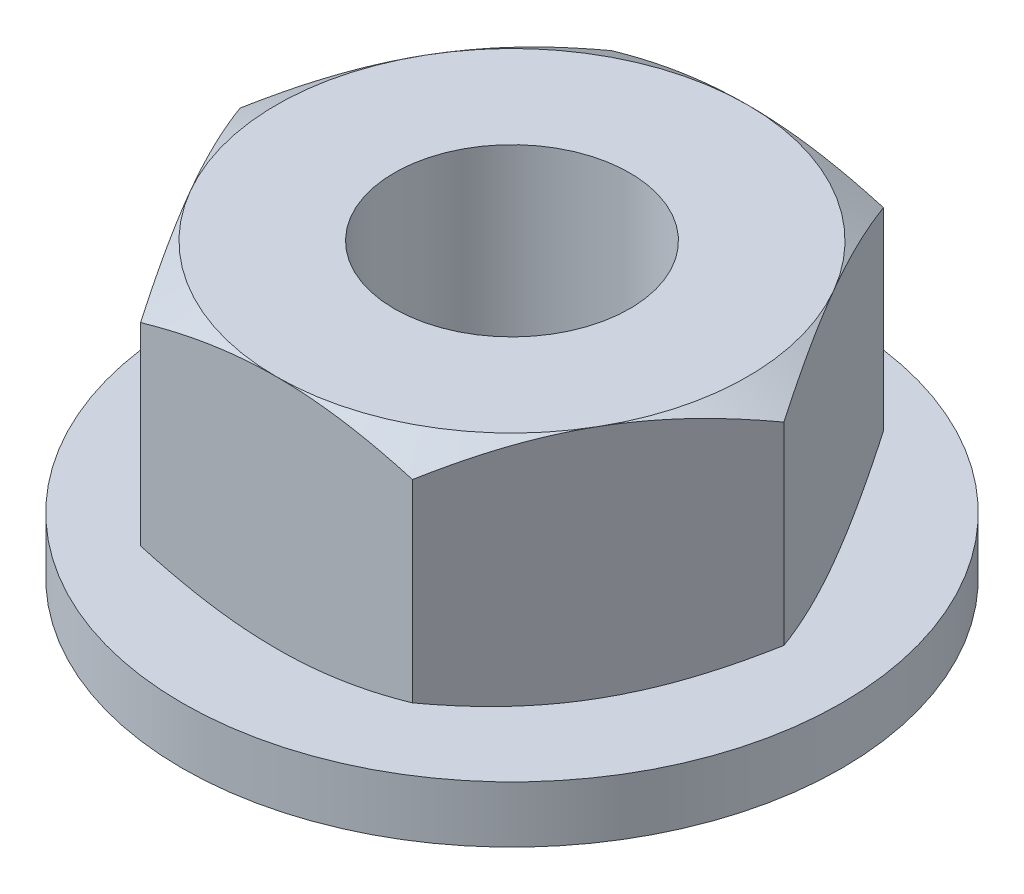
ISO-10303-21;
HEADER;
FILE_DESCRIPTION(('STEP AP214'),'2;1');
FILE_NAME('part.step','',(''),(''),'','','');
FILE_SCHEMA(('AUTOMOTIVE_DESIGN { 1 0 10303 214 1 1 1 1 }'));
ENDSEC;
DATA;
#1=APPLICATION_CONTEXT('core data for automotive mechanical design processes');
#2=APPLICATION_PROTOCOL_DEFINITION('international standard','automotive_design',2000,#1);
#3=PRODUCT_CONTEXT('',#1,'mechanical');
#4=PRODUCT('Part','Part','',(#3));
#5=PRODUCT_RELATED_PRODUCT_CATEGORY('part','',(#4));
#6=PRODUCT_DEFINITION_FORMATION('','',#4);
#7=PRODUCT_DEFINITION_CONTEXT('part definition',#1,'design');
#8=PRODUCT_DEFINITION('design','',#6,#7);
#9=PRODUCT_DEFINITION_SHAPE('','',#8);
#10=(LENGTH_UNIT() NAMED_UNIT(*) SI_UNIT(.MILLI.,.METRE.));
#11=(NAMED_UNIT(*) PLANE_ANGLE_UNIT() SI_UNIT($,.RADIAN.));
#12=(NAMED_UNIT(*) SI_UNIT($,.STERADIAN.) SOLID_ANGLE_UNIT());
#13=UNCERTAINTY_MEASURE_WITH_UNIT(LENGTH_MEASURE(1.E-05),#10,'distance_accuracy_value','');
#14=(GEOMETRIC_REPRESENTATION_CONTEXT(3) GLOBAL_UNCERTAINTY_ASSIGNED_CONTEXT((#13)) GLOBAL_UNIT_ASSIGNED_CONTEXT((#10,
#11,#12)) REPRESENTATION_CONTEXT('',''));
#15=CARTESIAN_POINT('',(0.,0.,0.));
#16=DIRECTION('',(0.,0.,1.));
#17=DIRECTION('',(1.,0.,0.));
#18=AXIS2_PLACEMENT_3D('',#15,#16,#17);
#19=CARTESIAN_POINT('',(8.66025403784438,-2.5,-5.00000000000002));
#20=DIRECTION('',(0.,1.,0.));
#21=DIRECTION('',(0.,0.,1.));
#22=AXIS2_PLACEMENT_3D('',#19,#20,#21);
#23=PLANE('',#22);
#24=CARTESIAN_POINT('',(0.,-2.50000000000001,0.));
#25=DIRECTION('',(0.,1.,0.));
#26=DIRECTION('',(0.,0.,1.));
#27=AXIS2_PLACEMENT_3D('',#24,#25,#26);
#28=CIRCLE('',#27,2.5);
#29=CARTESIAN_POINT('',(0.,-2.50000000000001,2.5));
#30=VERTEX_POINT('',#29);
#31=EDGE_CURVE('E153',#30,#30,#28,.T.);
#32=ORIENTED_EDGE('',*,*,#31,.T.);
#33=EDGE_LOOP('',(#32));
#34=FACE_BOUND('',#33,.T.);
#35=CARTESIAN_POINT('',(0.,-2.5,0.));
#36=DIRECTION('',(0.,1.,0.));
#37=DIRECTION('',(0.,0.,1.));
#38=AXIS2_PLACEMENT_3D('',#35,#36,#37);
#39=CIRCLE('',#38,3.5);
#40=CARTESIAN_POINT('',(0.,-2.5,3.5));
#41=VERTEX_POINT('',#40);
#42=EDGE_CURVE('E11',#41,#41,#39,.T.);
#43=ORIENTED_EDGE('',*,*,#42,.F.);
#44=EDGE_LOOP('',(#43));
#45=FACE_BOUND('',#44,.T.);
#46=ADVANCED_FACE('F31',(#34,#45),#23,.F.);
#47=CARTESIAN_POINT('',(2.88675134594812,2.5,5.00000000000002));
#48=DIRECTION('',(-0.866025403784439,0.,-0.499999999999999));
#49=DIRECTION('',(-0.499999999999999,0.,0.866025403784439));
#50=AXIS2_PLACEMENT_3D('',#47,#48,#49);
#51=PLANE('',#50);
#52=CARTESIAN_POINT('',(5.7736181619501,-2.05335134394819,-0.000200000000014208));
#53=CARTESIAN_POINT('',(5.64675433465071,-2.12661343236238,0.219534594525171));
#54=CARTESIAN_POINT('',(5.5188054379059,-2.19324867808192,0.441148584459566));
#55=CARTESIAN_POINT('',(5.26069210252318,-2.3095610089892,0.888213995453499));
#56=CARTESIAN_POINT('',(5.13052307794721,-2.35919695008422,1.11367335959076));
#57=CARTESIAN_POINT('',(4.87177839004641,-2.43644897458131,1.56183230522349));
#58=CARTESIAN_POINT('',(4.74324302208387,-2.46457962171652,1.78446209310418));
#59=CARTESIAN_POINT('',(4.54998783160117,-2.48980507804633,2.11918990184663));
#60=CARTESIAN_POINT('',(4.48552534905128,-2.49538654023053,2.23084219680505));
#61=CARTESIAN_POINT('',(4.35654081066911,-2.50079778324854,2.45424997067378));
#62=CARTESIAN_POINT('',(4.2920187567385,-2.50062774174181,2.5660054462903));
#63=CARTESIAN_POINT('',(4.11524635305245,-2.49224636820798,2.87218423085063));
#64=CARTESIAN_POINT('',(4.00305457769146,-2.47817022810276,3.0665060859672));
#65=CARTESIAN_POINT('',(3.77941563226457,-2.43353474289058,3.4538601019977));
#66=CARTESIAN_POINT('',(3.66796924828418,-2.40296013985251,3.64689090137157));
#67=CARTESIAN_POINT('',(3.44387972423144,-2.32653150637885,4.03502534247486));
#68=CARTESIAN_POINT('',(3.3312648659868,-2.28035362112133,4.23007999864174));
#69=CARTESIAN_POINT('',(3.1077146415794,-2.17554820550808,4.61728034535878));
#70=CARTESIAN_POINT('',(2.99677641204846,-2.11694529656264,4.8094309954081));
#71=CARTESIAN_POINT('',(2.88663587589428,-2.05335134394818,5.00020000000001));
#72=B_SPLINE_CURVE_WITH_KNOTS('',3,(#52,#53,#54,#55,#56,#57,#58,#59,#60,#61,#62,#63,#64,#65,#66,
#67,#68,#69,#70,#71),.UNSPECIFIED.,.F.,.F.,(4,2,2,2,2,2,2,2,2,4),(0.,0.792555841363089,
1.58701660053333,2.3618153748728,2.74884076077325,3.13585419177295,3.8096236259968,
4.4840172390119,5.17336882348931,5.86136694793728),.UNSPECIFIED.);
#73=CARTESIAN_POINT('',(5.77350269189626,-2.05341801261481,0.));
#74=VERTEX_POINT('',#73);
#75=CARTESIAN_POINT('',(4.33012701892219,-2.5,2.5));
#76=VERTEX_POINT('',#75);
#77=EDGE_CURVE('E191',#74,#76,#72,.T.);
#78=ORIENTED_EDGE('',*,*,#77,.F.);
#79=DIRECTION('',(0.,-1.,0.));
#80=VECTOR('',#79,1.);
#81=CARTESIAN_POINT('',(5.77350269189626,2.5,0.));
#82=LINE('',#81,#80);
#83=CARTESIAN_POINT('',(5.77350269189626,2.05341801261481,0.));
#84=VERTEX_POINT('',#83);
#85=EDGE_CURVE('E278',#84,#74,#82,.T.);
#86=ORIENTED_EDGE('',*,*,#85,.F.);
#87=CARTESIAN_POINT('',(2.88663587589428,2.05335134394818,5.00020000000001));
#88=CARTESIAN_POINT('',(3.01349970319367,2.12661343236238,4.78046540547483));
#89=CARTESIAN_POINT('',(3.14144859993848,2.19324867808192,4.55885141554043));
#90=CARTESIAN_POINT('',(3.3995619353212,2.3095610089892,4.1117860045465));
#91=CARTESIAN_POINT('',(3.52973095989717,2.35919695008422,3.88632664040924));
#92=CARTESIAN_POINT('',(3.78847564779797,2.43644897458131,3.4381676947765));
#93=CARTESIAN_POINT('',(3.91701101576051,2.46457962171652,3.21553790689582));
#94=CARTESIAN_POINT('',(4.11026620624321,2.48980507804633,2.88081009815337));
#95=CARTESIAN_POINT('',(4.1747286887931,2.49538654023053,2.76915780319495));
#96=CARTESIAN_POINT('',(4.30371322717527,2.50079778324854,2.54575002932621));
#97=CARTESIAN_POINT('',(4.36823528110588,2.50062774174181,2.4339945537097));
#98=CARTESIAN_POINT('',(4.54500768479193,2.49224636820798,2.12781576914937));
#99=CARTESIAN_POINT('',(4.65719946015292,2.47817022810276,1.93349391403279));
#100=CARTESIAN_POINT('',(4.88083840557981,2.43353474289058,1.5461398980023));
#101=CARTESIAN_POINT('',(4.9922847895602,2.40296013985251,1.35310909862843));
#102=CARTESIAN_POINT('',(5.21637431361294,2.32653150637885,0.964974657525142));
#103=CARTESIAN_POINT('',(5.32898917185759,2.28035362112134,0.769920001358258));
#104=CARTESIAN_POINT('',(5.55253939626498,2.17554820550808,0.382719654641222));
#105=CARTESIAN_POINT('',(5.66347762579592,2.11694529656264,0.190569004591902));
#106=CARTESIAN_POINT('',(5.7736181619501,2.05335134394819,-0.000200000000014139));
#107=B_SPLINE_CURVE_WITH_KNOTS('',3,(#87,#88,#89,#90,#91,#92,#93,#94,#95,#96,#97,#98,#99,#100,
#101,#102,#103,#104,#105,#106),.UNSPECIFIED.,.F.,.F.,(4,2,2,2,2,2,2,2,2,4),(0.,
0.792555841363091,1.58701660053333,2.36181537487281,2.74884076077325,3.13585419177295,
3.8096236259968,4.48401723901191,5.17336882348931,5.86136694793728),.UNSPECIFIED.);
#108=CARTESIAN_POINT('',(4.33012701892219,2.5,2.5));
#109=VERTEX_POINT('',#108);
#110=EDGE_CURVE('E190',#109,#84,#107,.T.);
#111=ORIENTED_EDGE('',*,*,#110,.F.);
#112=CARTESIAN_POINT('',(2.88675134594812,2.05341801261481,5.00000000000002));
#113=VERTEX_POINT('',#112);
#114=EDGE_CURVE('E310',#113,#109,#107,.T.);
#115=ORIENTED_EDGE('',*,*,#114,.F.);
#116=DIRECTION('',(0.,-1.,0.));
#117=VECTOR('',#116,1.);
#118=CARTESIAN_POINT('',(2.88675134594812,2.5,5.00000000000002));
#119=LINE('',#118,#117);
#120=CARTESIAN_POINT('',(2.88675134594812,-2.05341801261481,5.00000000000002));
#121=VERTEX_POINT('',#120);
#122=EDGE_CURVE('E306',#113,#121,#119,.T.);
#123=ORIENTED_EDGE('',*,*,#122,.T.);
#124=EDGE_CURVE('E142',#76,#121,#72,.T.);
#125=ORIENTED_EDGE('',*,*,#124,.F.);
#126=EDGE_LOOP('',(#78,#86,#111,#115,#123,#125));
#127=FACE_BOUND('',#126,.T.);
#128=ADVANCED_FACE('F33',(#127),#51,.F.);
#129=CARTESIAN_POINT('',(5.77350269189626,2.5,0.));
#130=DIRECTION('',(-0.866025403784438,0.,0.5));
#131=DIRECTION('',(0.5,0.,0.866025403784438));
#132=AXIS2_PLACEMENT_3D('',#129,#130,#131);
#133=PLANE('',#132);
#134=CARTESIAN_POINT('',(2.88663587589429,-2.05335134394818,-5.00020000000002));
#135=CARTESIAN_POINT('',(3.01349970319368,-2.12661343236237,-4.78046540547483));
#136=CARTESIAN_POINT('',(3.14144859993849,-2.19324867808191,-4.55885141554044));
#137=CARTESIAN_POINT('',(3.3995619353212,-2.3095610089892,-4.1117860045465));
#138=CARTESIAN_POINT('',(3.52973095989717,-2.35919695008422,-3.88632664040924));
#139=CARTESIAN_POINT('',(3.78847564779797,-2.43644897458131,-3.43816769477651));
#140=CARTESIAN_POINT('',(3.91701101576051,-2.46457962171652,-3.21553790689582));
#141=CARTESIAN_POINT('',(4.11026620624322,-2.48980507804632,-2.88081009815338));
#142=CARTESIAN_POINT('',(4.17472868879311,-2.49538654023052,-2.76915780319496));
#143=CARTESIAN_POINT('',(4.30371322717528,-2.50079778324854,-2.54575002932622));
#144=CARTESIAN_POINT('',(4.36823528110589,-2.5006277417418,-2.4339945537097));
#145=CARTESIAN_POINT('',(4.54500768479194,-2.49224636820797,-2.12781576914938));
#146=CARTESIAN_POINT('',(4.65719946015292,-2.47817022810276,-1.9334939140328));
#147=CARTESIAN_POINT('',(4.88083840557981,-2.43353474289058,-1.54613989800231));
#148=CARTESIAN_POINT('',(4.9922847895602,-2.4029601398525,-1.35310909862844));
#149=CARTESIAN_POINT('',(5.21637431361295,-2.32653150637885,-0.96497465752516));
#150=CARTESIAN_POINT('',(5.32898917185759,-2.28035362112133,-0.769920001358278));
#151=CARTESIAN_POINT('',(5.55253939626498,-2.17554820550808,-0.382719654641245));
#152=CARTESIAN_POINT('',(5.66347762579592,-2.11694529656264,-0.190569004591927));
#153=CARTESIAN_POINT('',(5.7736181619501,-2.05335134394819,0.000199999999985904));
#154=B_SPLINE_CURVE_WITH_KNOTS('',3,(#134,#135,#136,#137,#138,#139,#140,#141,#142,#143,#144,
#145,#146,#147,#148,#149,#150,#151,#152,#153),.UNSPECIFIED.,.F.,.F.,(4,2,2,2,2,2,2,2,2,4),(0.,
0.792555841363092,1.58701660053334,2.36181537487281,2.74884076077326,3.13585419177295,
3.8096236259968,4.4840172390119,5.17336882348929,5.86136694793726),.UNSPECIFIED.);
#155=CARTESIAN_POINT('',(2.88675134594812,-2.05341801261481,-5.00000000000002));
#156=VERTEX_POINT('',#155);
#157=CARTESIAN_POINT('',(4.33012701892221,-2.5,-2.50000000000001));
#158=VERTEX_POINT('',#157);
#159=EDGE_CURVE('E193',#156,#158,#154,.T.);
#160=ORIENTED_EDGE('',*,*,#159,.F.);
#161=DIRECTION('',(0.,-1.,0.));
#162=VECTOR('',#161,1.);
#163=CARTESIAN_POINT('',(2.88675134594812,2.5,-5.00000000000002));
#164=LINE('',#163,#162);
#165=CARTESIAN_POINT('',(2.88675134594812,2.05341801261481,-5.00000000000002));
#166=VERTEX_POINT('',#165);
#167=EDGE_CURVE('E275',#166,#156,#164,.T.);
#168=ORIENTED_EDGE('',*,*,#167,.F.);
#169=CARTESIAN_POINT('',(5.7736181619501,2.05335134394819,0.000199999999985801));
#170=CARTESIAN_POINT('',(5.64675433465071,2.12661343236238,-0.219534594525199));
#171=CARTESIAN_POINT('',(5.5188054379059,2.19324867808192,-0.441148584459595));
#172=CARTESIAN_POINT('',(5.26069210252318,2.3095610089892,-0.888213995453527));
#173=CARTESIAN_POINT('',(5.13052307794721,2.35919695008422,-1.11367335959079));
#174=CARTESIAN_POINT('',(4.87177839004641,2.43644897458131,-1.56183230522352));
#175=CARTESIAN_POINT('',(4.74324302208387,2.46457962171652,-1.7844620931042));
#176=CARTESIAN_POINT('',(4.54998783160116,2.48980507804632,-2.11918990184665));
#177=CARTESIAN_POINT('',(4.48552534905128,2.49538654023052,-2.23084219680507));
#178=CARTESIAN_POINT('',(4.35654081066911,2.50079778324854,-2.45424997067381));
#179=CARTESIAN_POINT('',(4.2920187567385,2.5006277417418,-2.56600544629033));
#180=CARTESIAN_POINT('',(4.11524635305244,2.49224636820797,-2.87218423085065));
#181=CARTESIAN_POINT('',(4.00305457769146,2.47817022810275,-3.06650608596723));
#182=CARTESIAN_POINT('',(3.77941563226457,2.43353474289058,-3.45386010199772));
#183=CARTESIAN_POINT('',(3.66796924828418,2.4029601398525,-3.64689090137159));
#184=CARTESIAN_POINT('',(3.44387972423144,2.32653150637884,-4.03502534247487));
#185=CARTESIAN_POINT('',(3.3312648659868,2.28035362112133,-4.23007999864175));
#186=CARTESIAN_POINT('',(3.1077146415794,2.17554820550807,-4.61728034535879));
#187=CARTESIAN_POINT('',(2.99677641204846,2.11694529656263,-4.80943099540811));
#188=CARTESIAN_POINT('',(2.88663587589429,2.05335134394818,-5.00020000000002));
#189=B_SPLINE_CURVE_WITH_KNOTS('',3,(#169,#170,#171,#172,#173,#174,#175,#176,#177,#178,#179,
#180,#181,#182,#183,#184,#185,#186,#187,#188),.UNSPECIFIED.,.F.,.F.,(4,2,2,2,2,2,2,2,2,4),(0.,
0.79255584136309,1.58701660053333,2.3618153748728,2.74884076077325,3.13585419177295,
3.80962362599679,4.48401723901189,5.17336882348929,5.86136694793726),.UNSPECIFIED.);
#190=CARTESIAN_POINT('',(4.3301270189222,2.5,-2.5));
#191=VERTEX_POINT('',#190);
#192=EDGE_CURVE('E318',#191,#166,#189,.T.);
#193=ORIENTED_EDGE('',*,*,#192,.F.);
#194=EDGE_CURVE('E213',#84,#191,#189,.T.);
#195=ORIENTED_EDGE('',*,*,#194,.F.);
#196=ORIENTED_EDGE('',*,*,#85,.T.);
#197=EDGE_CURVE('E539',#158,#74,#154,.T.);
#198=ORIENTED_EDGE('',*,*,#197,.F.);
#199=EDGE_LOOP('',(#160,#168,#193,#195,#196,#198));
#200=FACE_BOUND('',#199,.T.);
#201=ADVANCED_FACE('F333',(#200),#133,.F.);
#202=CARTESIAN_POINT('',(2.88675134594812,2.5,-5.00000000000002));
#203=DIRECTION('',(0.,0.,1.));
#204=DIRECTION('',(1.,0.,0.));
#205=AXIS2_PLACEMENT_3D('',#202,#203,#204);
#206=PLANE('',#205);
#207=CARTESIAN_POINT('',(-7.83582824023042,-0.0201818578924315,-5.00000000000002));
#208=CARTESIAN_POINT('',(-7.61675258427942,-0.126778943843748,-5.00000000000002));
#209=CARTESIAN_POINT('',(-7.39718272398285,-0.232377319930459,-5.00000000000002));
#210=CARTESIAN_POINT('',(-6.95679209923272,-0.441016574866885,-5.00000000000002));
#211=CARTESIAN_POINT('',(-6.73597115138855,-0.54405706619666,-5.00000000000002));
#212=CARTESIAN_POINT('',(-6.29171673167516,-0.747521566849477,-5.00000000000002));
#213=CARTESIAN_POINT('',(-6.06827562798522,-0.847928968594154,-5.00000000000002));
#214=CARTESIAN_POINT('',(-5.61964466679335,-1.04474266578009,-5.00000000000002));
#215=CARTESIAN_POINT('',(-5.39445489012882,-1.14114914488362,-5.00000000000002));
#216=CARTESIAN_POINT('',(-4.93438073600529,-1.33205603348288,-5.00000000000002));
#217=CARTESIAN_POINT('',(-4.69942447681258,-1.42638413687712,-5.00000000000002));
#218=CARTESIAN_POINT('',(-4.22679335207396,-1.60809698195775,-5.00000000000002));
#219=CARTESIAN_POINT('',(-3.98911818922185,-1.69548095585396,-5.00000000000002));
#220=CARTESIAN_POINT('',(-3.51109032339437,-1.86107114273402,-5.00000000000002));
#221=CARTESIAN_POINT('',(-3.27074388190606,-1.93929525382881,-5.00000000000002));
#222=CARTESIAN_POINT('',(-2.78660382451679,-2.08410963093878,-5.00000000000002));
#223=CARTESIAN_POINT('',(-2.54281129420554,-2.15070347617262,-5.00000000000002));
#224=CARTESIAN_POINT('',(-2.05301710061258,-2.26875493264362,-5.00000000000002));
#225=CARTESIAN_POINT('',(-1.80703640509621,-2.32029796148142,-5.00000000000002));
#226=CARTESIAN_POINT('',(-1.31193168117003,-2.40539626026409,-5.00000000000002));
#227=CARTESIAN_POINT('',(-1.0628079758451,-2.43895336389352,-5.00000000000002));
#228=CARTESIAN_POINT('',(-0.565948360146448,-2.48496717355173,-5.00000000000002));
#229=CARTESIAN_POINT('',(-0.318238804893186,-2.49770143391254,-5.00000000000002));
#230=CARTESIAN_POINT('',(0.17737746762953,-2.50172580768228,-5.00000000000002));
#231=CARTESIAN_POINT('',(0.425284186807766,-2.4930157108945,-5.00000000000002));
#232=CARTESIAN_POINT('',(0.843772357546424,-2.46083600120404,-5.00000000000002));
#233=CARTESIAN_POINT('',(1.01479089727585,-2.44270146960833,-5.00000000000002));
#234=CARTESIAN_POINT('',(1.35562158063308,-2.39731277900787,-5.00000000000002));
#235=CARTESIAN_POINT('',(1.52543356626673,-2.37005744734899,-5.00000000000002));
#236=CARTESIAN_POINT('',(2.0328088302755,-2.2760379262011,-5.00000000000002));
#237=CARTESIAN_POINT('',(2.36813213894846,-2.19703587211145,-5.00000000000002));
#238=CARTESIAN_POINT('',(2.86963272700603,-2.05946652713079,-5.00000000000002));
#239=CARTESIAN_POINT('',(3.03839424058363,-2.00977811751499,-5.00000000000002));
#240=CARTESIAN_POINT('',(3.37427940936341,-1.90509537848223,-5.00000000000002));
#241=CARTESIAN_POINT('',(3.54140305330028,-1.85010101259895,-5.00000000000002));
#242=CARTESIAN_POINT('',(3.87406252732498,-1.73570084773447,-5.00000000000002));
#243=CARTESIAN_POINT('',(4.03959882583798,-1.67629639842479,-5.00000000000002));
#244=CARTESIAN_POINT('',(4.36929036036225,-1.55378935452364,-5.00000000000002));
#245=CARTESIAN_POINT('',(4.53344561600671,-1.49068681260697,-5.00000000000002));
#246=CARTESIAN_POINT('',(4.93359002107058,-1.33251408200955,-5.00000000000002));
#247=CARTESIAN_POINT('',(5.16891080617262,-1.23575576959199,-5.00000000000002));
#248=CARTESIAN_POINT('',(5.63743106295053,-1.03721704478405,-5.00000000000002));
#249=CARTESIAN_POINT('',(5.87063037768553,-0.935436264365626,-5.00000000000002));
#250=CARTESIAN_POINT('',(6.33531777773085,-0.727904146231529,-5.00000000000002));
#251=CARTESIAN_POINT('',(6.56680543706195,-0.622151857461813,-5.00000000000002));
#252=CARTESIAN_POINT('',(7.02832278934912,-0.407506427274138,-5.00000000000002));
#253=CARTESIAN_POINT('',(7.25835244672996,-0.298613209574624,-5.00000000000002));
#254=CARTESIAN_POINT('',(7.71747583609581,-0.0781683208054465,-5.00000000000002));
#255=CARTESIAN_POINT('',(7.94656809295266,0.0333864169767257,-5.00000000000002));
#256=CARTESIAN_POINT('',(8.40373705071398,0.258559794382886,-5.00000000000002));
#257=CARTESIAN_POINT('',(8.63181374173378,0.372178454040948,-5.00000000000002));
#258=CARTESIAN_POINT('',(9.31470112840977,0.715524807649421,-5.00000000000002));
#259=CARTESIAN_POINT('',(9.76824174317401,0.947778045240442,-5.00000000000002));
#260=CARTESIAN_POINT('',(10.6324695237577,1.39599360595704,-5.00000000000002));
#261=CARTESIAN_POINT('',(11.0433644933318,1.61155711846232,-5.00000000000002));
#262=CARTESIAN_POINT('',(11.8636388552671,2.04558815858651,-5.00000000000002));
#263=CARTESIAN_POINT('',(12.2730181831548,2.26405580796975,-5.00000000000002));
#264=CARTESIAN_POINT('',(13.0894643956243,2.70257621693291,-5.00000000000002));
#265=CARTESIAN_POINT('',(13.4965345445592,2.9226229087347,-5.00000000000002));
#266=CARTESIAN_POINT('',(14.3097130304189,3.36442738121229,-5.00000000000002));
#267=CARTESIAN_POINT('',(14.7158214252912,3.58618505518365,-5.00000000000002));
#268=CARTESIAN_POINT('',(15.1215799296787,3.80857680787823,-5.00000000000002));
#269=B_SPLINE_CURVE_WITH_KNOTS('',3,(#207,#208,#209,#210,#211,#212,#213,#214,#215,#216,#217,
#218,#219,#220,#221,#222,#223,#224,#225,#226,#227,#228,#229,#230,#231,#232,#233,#234,#235,#236,
#237,#238,#239,#240,#241,#242,#243,#244,#245,#246,#247,#248,#249,#250,#251,#252,#253,#254,#255,
#256,#257,#258,#259,#260,#261,#262,#263,#264,#265,#266,#267,#268),.UNSPECIFIED.,.F.,.F.,(4,2,2,
2,2,2,2,2,2,2,2,2,2,2,2,2,2,2,2,2,2,2,2,2,2,2,2,2,2,2,4),(0.,0.730907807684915,1.46192568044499,
2.19678752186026,2.93161559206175,3.69108328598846,4.45063483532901,5.20867656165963,
5.96648458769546,6.71990430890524,7.47324720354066,8.21646418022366,8.95968844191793,
9.47537174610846,9.99112137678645,11.0231580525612,11.5508843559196,12.0786142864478,
12.6061833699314,13.1337449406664,13.8969744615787,14.6602599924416,15.4237294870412,
16.187217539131,16.9516324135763,17.7160547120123,19.2446573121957,20.636665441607,
22.0287321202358,23.416942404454,24.805066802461),.UNSPECIFIED.);
#270=CARTESIAN_POINT('',(-2.88675134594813,-2.0534180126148,-5.00000000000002));
#271=VERTEX_POINT('',#270);
#272=CARTESIAN_POINT('',(0.,-2.5,-5.00000000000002));
#273=VERTEX_POINT('',#272);
#274=EDGE_CURVE('E252',#271,#273,#269,.T.);
#275=ORIENTED_EDGE('',*,*,#274,.F.);
#276=DIRECTION('',(0.,-1.,0.));
#277=VECTOR('',#276,1.);
#278=CARTESIAN_POINT('',(-2.88675134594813,2.5,-5.00000000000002));
#279=LINE('',#278,#277);
#280=CARTESIAN_POINT('',(-2.88675134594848,2.05341801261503,-5.00000000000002));
#281=VERTEX_POINT('',#280);
#282=EDGE_CURVE('E271',#281,#271,#279,.T.);
#283=ORIENTED_EDGE('',*,*,#282,.F.);
#284=CARTESIAN_POINT('',(-7.83582824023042,0.0201818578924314,-5.00000000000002));
#285=CARTESIAN_POINT('',(-7.61675258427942,0.126778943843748,-5.00000000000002));
#286=CARTESIAN_POINT('',(-7.39718272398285,0.232377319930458,-5.00000000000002));
#287=CARTESIAN_POINT('',(-6.95679209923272,0.441016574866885,-5.00000000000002));
#288=CARTESIAN_POINT('',(-6.73597115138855,0.54405706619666,-5.00000000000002));
#289=CARTESIAN_POINT('',(-6.29171673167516,0.747521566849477,-5.00000000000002));
#290=CARTESIAN_POINT('',(-6.06827562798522,0.847928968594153,-5.00000000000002));
#291=CARTESIAN_POINT('',(-5.61964466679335,1.04474266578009,-5.00000000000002));
#292=CARTESIAN_POINT('',(-5.39445489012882,1.14114914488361,-5.00000000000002));
#293=CARTESIAN_POINT('',(-4.93438073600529,1.33205603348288,-5.00000000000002));
#294=CARTESIAN_POINT('',(-4.69942447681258,1.42638413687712,-5.00000000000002));
#295=CARTESIAN_POINT('',(-4.22679335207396,1.60809698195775,-5.00000000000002));
#296=CARTESIAN_POINT('',(-3.98911818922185,1.69548095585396,-5.00000000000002));
#297=CARTESIAN_POINT('',(-3.51109032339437,1.86107114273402,-5.00000000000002));
#298=CARTESIAN_POINT('',(-3.27074388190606,1.93929525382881,-5.00000000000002));
#299=CARTESIAN_POINT('',(-2.78660382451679,2.08410963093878,-5.00000000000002));
#300=CARTESIAN_POINT('',(-2.54281129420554,2.15070347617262,-5.00000000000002));
#301=CARTESIAN_POINT('',(-2.05301710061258,2.26875493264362,-5.00000000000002));
#302=CARTESIAN_POINT('',(-1.80703640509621,2.32029796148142,-5.00000000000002));
#303=CARTESIAN_POINT('',(-1.31193168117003,2.40539626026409,-5.00000000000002));
#304=CARTESIAN_POINT('',(-1.0628079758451,2.43895336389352,-5.00000000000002));
#305=CARTESIAN_POINT('',(-0.565948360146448,2.48496717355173,-5.00000000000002));
#306=CARTESIAN_POINT('',(-0.318238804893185,2.49770143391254,-5.00000000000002));
#307=CARTESIAN_POINT('',(0.177377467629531,2.50172580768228,-5.00000000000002));
#308=CARTESIAN_POINT('',(0.425284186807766,2.4930157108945,-5.00000000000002));
#309=CARTESIAN_POINT('',(0.843772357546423,2.46083600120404,-5.00000000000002));
#310=CARTESIAN_POINT('',(1.01479089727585,2.44270146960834,-5.00000000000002));
#311=CARTESIAN_POINT('',(1.35562158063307,2.39731277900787,-5.00000000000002));
#312=CARTESIAN_POINT('',(1.52543356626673,2.37005744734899,-5.00000000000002));
#313=CARTESIAN_POINT('',(2.0328088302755,2.2760379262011,-5.00000000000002));
#314=CARTESIAN_POINT('',(2.36813213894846,2.19703587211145,-5.00000000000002));
#315=CARTESIAN_POINT('',(2.86963272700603,2.05946652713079,-5.00000000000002));
#316=CARTESIAN_POINT('',(3.03839424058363,2.00977811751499,-5.00000000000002));
#317=CARTESIAN_POINT('',(3.37427940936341,1.90509537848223,-5.00000000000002));
#318=CARTESIAN_POINT('',(3.54140305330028,1.85010101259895,-5.00000000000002));
#319=CARTESIAN_POINT('',(3.87406252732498,1.73570084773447,-5.00000000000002));
#320=CARTESIAN_POINT('',(4.03959882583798,1.67629639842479,-5.00000000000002));
#321=CARTESIAN_POINT('',(4.36929036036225,1.55378935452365,-5.00000000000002));
#322=CARTESIAN_POINT('',(4.53344561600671,1.49068681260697,-5.00000000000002));
#323=CARTESIAN_POINT('',(4.93359002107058,1.33251408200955,-5.00000000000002));
#324=CARTESIAN_POINT('',(5.16891080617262,1.23575576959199,-5.00000000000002));
#325=CARTESIAN_POINT('',(5.63743106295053,1.03721704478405,-5.00000000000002));
#326=CARTESIAN_POINT('',(5.87063037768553,0.935436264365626,-5.00000000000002));
#327=CARTESIAN_POINT('',(6.33531777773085,0.727904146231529,-5.00000000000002));
#328=CARTESIAN_POINT('',(6.56680543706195,0.622151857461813,-5.00000000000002));
#329=CARTESIAN_POINT('',(7.02832278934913,0.407506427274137,-5.00000000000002));
#330=CARTESIAN_POINT('',(7.25835244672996,0.298613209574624,-5.00000000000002));
#331=CARTESIAN_POINT('',(7.71747583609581,0.0781683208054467,-5.00000000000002));
#332=CARTESIAN_POINT('',(7.94656809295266,-0.0333864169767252,-5.00000000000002));
#333=CARTESIAN_POINT('',(8.40373705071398,-0.258559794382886,-5.00000000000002));
#334=CARTESIAN_POINT('',(8.63181374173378,-0.372178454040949,-5.00000000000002));
#335=CARTESIAN_POINT('',(9.31470112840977,-0.715524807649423,-5.00000000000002));
#336=CARTESIAN_POINT('',(9.76824174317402,-0.947778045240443,-5.00000000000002));
#337=CARTESIAN_POINT('',(10.6324695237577,-1.39599360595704,-5.00000000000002));
#338=CARTESIAN_POINT('',(11.0433644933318,-1.61155711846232,-5.00000000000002));
#339=CARTESIAN_POINT('',(11.8636388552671,-2.04558815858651,-5.00000000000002));
#340=CARTESIAN_POINT('',(12.2730181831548,-2.26405580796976,-5.00000000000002));
#341=CARTESIAN_POINT('',(13.0894643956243,-2.70257621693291,-5.00000000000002));
#342=CARTESIAN_POINT('',(13.4965345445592,-2.92262290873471,-5.00000000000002));
#343=CARTESIAN_POINT('',(14.3097130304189,-3.36442738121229,-5.00000000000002));
#344=CARTESIAN_POINT('',(14.7158214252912,-3.58618505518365,-5.00000000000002));
#345=CARTESIAN_POINT('',(15.1215799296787,-3.80857680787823,-5.00000000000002));
#346=B_SPLINE_CURVE_WITH_KNOTS('',3,(#284,#285,#286,#287,#288,#289,#290,#291,#292,#293,#294,
#295,#296,#297,#298,#299,#300,#301,#302,#303,#304,#305,#306,#307,#308,#309,#310,#311,#312,#313,
#314,#315,#316,#317,#318,#319,#320,#321,#322,#323,#324,#325,#326,#327,#328,#329,#330,#331,#332,
#333,#334,#335,#336,#337,#338,#339,#340,#341,#342,#343,#344,#345),.UNSPECIFIED.,.F.,.F.,(4,2,2,
2,2,2,2,2,2,2,2,2,2,2,2,2,2,2,2,2,2,2,2,2,2,2,2,2,2,2,4),(0.,0.730907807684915,1.46192568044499,
2.19678752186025,2.93161559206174,3.69108328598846,4.450634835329,5.20867656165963,
5.96648458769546,6.71990430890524,7.47324720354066,8.21646418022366,8.95968844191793,
9.47537174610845,9.99112137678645,11.0231580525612,11.5508843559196,12.0786142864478,
12.6061833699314,13.1337449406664,13.8969744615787,14.6602599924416,15.4237294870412,
16.187217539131,16.9516324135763,17.7160547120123,19.2446573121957,20.636665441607,
22.0287321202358,23.416942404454,24.805066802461),.UNSPECIFIED.);
#347=CARTESIAN_POINT('',(0.,2.5,-5.00000000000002));
#348=VERTEX_POINT('',#347);
#349=EDGE_CURVE('E229',#348,#281,#346,.F.);
#350=ORIENTED_EDGE('',*,*,#349,.F.);
#351=EDGE_CURVE('E218',#166,#348,#346,.F.);
#352=ORIENTED_EDGE('',*,*,#351,.F.);
#353=ORIENTED_EDGE('',*,*,#167,.T.);
#354=EDGE_CURVE('E257',#273,#156,#269,.T.);
#355=ORIENTED_EDGE('',*,*,#354,.F.);
#356=EDGE_LOOP('',(#275,#283,#350,#352,#353,#355));
#357=FACE_BOUND('',#356,.T.);
#358=ADVANCED_FACE('F238',(#357),#206,.F.);
#359=CARTESIAN_POINT('',(-2.88675134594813,2.5,-5.00000000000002));
#360=DIRECTION('',(0.866025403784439,0.,0.5));
#361=DIRECTION('',(0.5,0.,-0.866025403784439));
#362=AXIS2_PLACEMENT_3D('',#359,#360,#361);
#363=PLANE('',#362);
#364=CARTESIAN_POINT('',(-5.77361816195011,-2.05335134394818,0.000199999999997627));
#365=CARTESIAN_POINT('',(-5.64675433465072,-2.12661343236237,-0.219534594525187));
#366=CARTESIAN_POINT('',(-5.51880543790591,-2.19324867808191,-0.441148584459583));
#367=CARTESIAN_POINT('',(-5.26069210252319,-2.30956100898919,-0.888213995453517));
#368=CARTESIAN_POINT('',(-5.13052307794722,-2.35919695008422,-1.11367335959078));
#369=CARTESIAN_POINT('',(-4.87177839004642,-2.43644897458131,-1.56183230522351));
#370=CARTESIAN_POINT('',(-4.74324302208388,-2.46457962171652,-1.7844620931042));
#371=CARTESIAN_POINT('',(-4.54998783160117,-2.48980507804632,-2.11918990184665));
#372=CARTESIAN_POINT('',(-4.48552534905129,-2.49538654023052,-2.23084219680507));
#373=CARTESIAN_POINT('',(-4.35654081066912,-2.50079778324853,-2.4542499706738));
#374=CARTESIAN_POINT('',(-4.29201875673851,-2.5006277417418,-2.56600544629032));
#375=CARTESIAN_POINT('',(-4.11524635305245,-2.49224636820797,-2.87218423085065));
#376=CARTESIAN_POINT('',(-4.00305457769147,-2.47817022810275,-3.06650608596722));
#377=CARTESIAN_POINT('',(-3.77941563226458,-2.43353474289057,-3.45386010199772));
#378=CARTESIAN_POINT('',(-3.66796924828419,-2.4029601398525,-3.64689090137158));
#379=CARTESIAN_POINT('',(-3.44387972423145,-2.32653150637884,-4.03502534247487));
#380=CARTESIAN_POINT('',(-3.33126486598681,-2.28035362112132,-4.23007999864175));
#381=CARTESIAN_POINT('',(-3.10771464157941,-2.17554820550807,-4.61728034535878));
#382=CARTESIAN_POINT('',(-2.99677641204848,-2.11694529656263,-4.8094309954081));
#383=CARTESIAN_POINT('',(-2.8866358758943,-2.05335134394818,-5.00020000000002));
#384=B_SPLINE_CURVE_WITH_KNOTS('',3,(#364,#365,#366,#367,#368,#369,#370,#371,#372,#373,#374,
#375,#376,#377,#378,#379,#380,#381,#382,#383),.UNSPECIFIED.,.F.,.F.,(4,2,2,2,2,2,2,2,2,4),(0.,
0.792555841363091,1.58701660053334,2.36181537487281,2.74884076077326,3.13585419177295,
3.8096236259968,4.4840172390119,5.1733688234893,5.86136694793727),.UNSPECIFIED.);
#385=CARTESIAN_POINT('',(-5.77350269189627,-2.05341801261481,0.));
#386=VERTEX_POINT('',#385);
#387=CARTESIAN_POINT('',(-4.33012701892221,-2.5,-2.50000000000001));
#388=VERTEX_POINT('',#387);
#389=EDGE_CURVE('E243',#386,#388,#384,.T.);
#390=ORIENTED_EDGE('',*,*,#389,.F.);
#391=DIRECTION('',(0.,-1.,0.));
#392=VECTOR('',#391,1.);
#393=CARTESIAN_POINT('',(-5.77350269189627,2.5,0.));
#394=LINE('',#393,#392);
#395=CARTESIAN_POINT('',(-5.77350269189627,2.05341801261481,0.));
#396=VERTEX_POINT('',#395);
#397=EDGE_CURVE('E276',#396,#386,#394,.T.);
#398=ORIENTED_EDGE('',*,*,#397,.F.);
#399=CARTESIAN_POINT('',(-2.8866358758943,2.05335134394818,-5.00020000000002));
#400=CARTESIAN_POINT('',(-3.01349970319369,2.12661343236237,-4.78046540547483));
#401=CARTESIAN_POINT('',(-3.1414485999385,2.19324867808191,-4.55885141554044));
#402=CARTESIAN_POINT('',(-3.39956193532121,2.30956100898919,-4.1117860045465));
#403=CARTESIAN_POINT('',(-3.52973095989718,2.35919695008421,-3.88632664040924));
#404=CARTESIAN_POINT('',(-3.78847564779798,2.43644897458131,-3.4381676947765));
#405=CARTESIAN_POINT('',(-3.91701101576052,2.46457962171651,-3.21553790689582));
#406=CARTESIAN_POINT('',(-4.11026620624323,2.48980507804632,-2.88081009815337));
#407=CARTESIAN_POINT('',(-4.17472868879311,2.49538654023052,-2.76915780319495));
#408=CARTESIAN_POINT('',(-4.30371322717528,2.50079778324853,-2.54575002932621));
#409=CARTESIAN_POINT('',(-4.3682352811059,2.5006277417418,-2.4339945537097));
#410=CARTESIAN_POINT('',(-4.54500768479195,2.49224636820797,-2.12781576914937));
#411=CARTESIAN_POINT('',(-4.65719946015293,2.47817022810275,-1.9334939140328));
#412=CARTESIAN_POINT('',(-4.88083840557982,2.43353474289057,-1.5461398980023));
#413=CARTESIAN_POINT('',(-4.99228478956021,2.4029601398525,-1.35310909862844));
#414=CARTESIAN_POINT('',(-5.21637431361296,2.32653150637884,-0.964974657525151));
#415=CARTESIAN_POINT('',(-5.3289891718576,2.28035362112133,-0.769920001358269));
#416=CARTESIAN_POINT('',(-5.55253939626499,2.17554820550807,-0.382719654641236));
#417=CARTESIAN_POINT('',(-5.66347762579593,2.11694529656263,-0.190569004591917));
#418=CARTESIAN_POINT('',(-5.77361816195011,2.05335134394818,0.000199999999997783));
#419=B_SPLINE_CURVE_WITH_KNOTS('',3,(#399,#400,#401,#402,#403,#404,#405,#406,#407,#408,#409,
#410,#411,#412,#413,#414,#415,#416,#417,#418),.UNSPECIFIED.,.F.,.F.,(4,2,2,2,2,2,2,2,2,4),(0.,
0.792555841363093,1.58701660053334,2.36181537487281,2.74884076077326,3.13585419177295,
3.8096236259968,4.4840172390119,5.1733688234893,5.86136694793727),.UNSPECIFIED.);
#420=CARTESIAN_POINT('',(-4.3301270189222,2.5,-2.5));
#421=VERTEX_POINT('',#420);
#422=EDGE_CURVE('E228',#421,#396,#419,.T.);
#423=ORIENTED_EDGE('',*,*,#422,.F.);
#424=EDGE_CURVE('E224',#281,#421,#419,.T.);
#425=ORIENTED_EDGE('',*,*,#424,.F.);
#426=ORIENTED_EDGE('',*,*,#282,.T.);
#427=EDGE_CURVE('E248',#388,#271,#384,.T.);
#428=ORIENTED_EDGE('',*,*,#427,.F.);
#429=EDGE_LOOP('',(#390,#398,#423,#425,#426,#428));
#430=FACE_BOUND('',#429,.T.);
#431=ADVANCED_FACE('F235',(#430),#363,.F.);
#432=CARTESIAN_POINT('',(-5.77350269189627,2.5,0.));
#433=DIRECTION('',(0.866025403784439,0.,-0.5));
#434=DIRECTION('',(-0.5,0.,-0.866025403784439));
#435=AXIS2_PLACEMENT_3D('',#432,#433,#434);
#436=PLANE('',#435);
#437=CARTESIAN_POINT('',(-2.88663587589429,-2.05335134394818,5.00020000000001));
#438=CARTESIAN_POINT('',(-3.01349970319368,-2.12661343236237,4.78046540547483));
#439=CARTESIAN_POINT('',(-3.14144859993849,-2.19324867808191,4.55885141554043));
#440=CARTESIAN_POINT('',(-3.39956193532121,-2.3095610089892,4.1117860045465));
#441=CARTESIAN_POINT('',(-3.52973095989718,-2.35919695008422,3.88632664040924));
#442=CARTESIAN_POINT('',(-3.78847564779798,-2.43644897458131,3.4381676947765));
#443=CARTESIAN_POINT('',(-3.91701101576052,-2.46457962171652,3.21553790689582));
#444=CARTESIAN_POINT('',(-4.11026620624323,-2.48980507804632,2.88081009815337));
#445=CARTESIAN_POINT('',(-4.17472868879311,-2.49538654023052,2.76915780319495));
#446=CARTESIAN_POINT('',(-4.30371322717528,-2.50079778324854,2.54575002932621));
#447=CARTESIAN_POINT('',(-4.36823528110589,-2.5006277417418,2.4339945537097));
#448=CARTESIAN_POINT('',(-4.54500768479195,-2.49224636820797,2.12781576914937));
#449=CARTESIAN_POINT('',(-4.65719946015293,-2.47817022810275,1.9334939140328));
#450=CARTESIAN_POINT('',(-4.88083840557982,-2.43353474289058,1.5461398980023));
#451=CARTESIAN_POINT('',(-4.99228478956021,-2.4029601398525,1.35310909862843));
#452=CARTESIAN_POINT('',(-5.21637431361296,-2.32653150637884,0.964974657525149));
#453=CARTESIAN_POINT('',(-5.3289891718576,-2.28035362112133,0.769920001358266));
#454=CARTESIAN_POINT('',(-5.55253939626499,-2.17554820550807,0.382719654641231));
#455=CARTESIAN_POINT('',(-5.66347762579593,-2.11694529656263,0.190569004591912));
#456=CARTESIAN_POINT('',(-5.77361816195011,-2.05335134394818,-0.000200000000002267));
#457=B_SPLINE_CURVE_WITH_KNOTS('',3,(#437,#438,#439,#440,#441,#442,#443,#444,#445,#446,#447,
#448,#449,#450,#451,#452,#453,#454,#455,#456),.UNSPECIFIED.,.F.,.F.,(4,2,2,2,2,2,2,2,2,4),(0.,
0.792555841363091,1.58701660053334,2.36181537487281,2.74884076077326,3.13585419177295,
3.8096236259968,4.4840172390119,5.1733688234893,5.86136694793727),.UNSPECIFIED.);
#458=CARTESIAN_POINT('',(-2.88675134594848,-2.05341801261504,5.00000000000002));
#459=VERTEX_POINT('',#458);
#460=CARTESIAN_POINT('',(-4.33012701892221,-2.5,2.50000000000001));
#461=VERTEX_POINT('',#460);
#462=EDGE_CURVE('E135',#459,#461,#457,.T.);
#463=ORIENTED_EDGE('',*,*,#462,.F.);
#464=DIRECTION('',(0.,-1.,0.));
#465=VECTOR('',#464,1.);
#466=CARTESIAN_POINT('',(-2.88675134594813,2.5,5.00000000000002));
#467=LINE('',#466,#465);
#468=CARTESIAN_POINT('',(-2.88675134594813,2.0534180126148,5.00000000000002));
#469=VERTEX_POINT('',#468);
#470=EDGE_CURVE('E152',#469,#459,#467,.T.);
#471=ORIENTED_EDGE('',*,*,#470,.F.);
#472=CARTESIAN_POINT('',(-5.77361816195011,2.05335134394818,-0.000200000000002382));
#473=CARTESIAN_POINT('',(-5.64675433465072,2.12661343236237,0.219534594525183));
#474=CARTESIAN_POINT('',(-5.51880543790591,2.19324867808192,0.441148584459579));
#475=CARTESIAN_POINT('',(-5.26069210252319,2.3095610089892,0.888213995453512));
#476=CARTESIAN_POINT('',(-5.13052307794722,2.35919695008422,1.11367335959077));
#477=CARTESIAN_POINT('',(-4.87177839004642,2.43644897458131,1.56183230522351));
#478=CARTESIAN_POINT('',(-4.74324302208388,2.46457962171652,1.78446209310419));
#479=CARTESIAN_POINT('',(-4.54998783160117,2.48980507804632,2.11918990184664));
#480=CARTESIAN_POINT('',(-4.48552534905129,2.49538654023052,2.23084219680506));
#481=CARTESIAN_POINT('',(-4.35654081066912,2.50079778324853,2.4542499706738));
#482=CARTESIAN_POINT('',(-4.29201875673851,2.5006277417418,2.56600544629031));
#483=CARTESIAN_POINT('',(-4.11524635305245,2.49224636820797,2.87218423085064));
#484=CARTESIAN_POINT('',(-4.00305457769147,2.47817022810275,3.06650608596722));
#485=CARTESIAN_POINT('',(-3.77941563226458,2.43353474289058,3.45386010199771));
#486=CARTESIAN_POINT('',(-3.66796924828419,2.4029601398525,3.64689090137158));
#487=CARTESIAN_POINT('',(-3.44387972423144,2.32653150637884,4.03502534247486));
#488=CARTESIAN_POINT('',(-3.33126486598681,2.28035362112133,4.23007999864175));
#489=CARTESIAN_POINT('',(-3.10771464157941,2.17554820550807,4.61728034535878));
#490=CARTESIAN_POINT('',(-2.99677641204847,2.11694529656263,4.8094309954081));
#491=CARTESIAN_POINT('',(-2.88663587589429,2.05335134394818,5.00020000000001));
#492=B_SPLINE_CURVE_WITH_KNOTS('',3,(#472,#473,#474,#475,#476,#477,#478,#479,#480,#481,#482,
#483,#484,#485,#486,#487,#488,#489,#490,#491),.UNSPECIFIED.,.F.,.F.,(4,2,2,2,2,2,2,2,2,4),(0.,
0.792555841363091,1.58701660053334,2.36181537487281,2.74884076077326,3.13585419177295,
3.8096236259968,4.4840172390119,5.1733688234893,5.86136694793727),.UNSPECIFIED.);
#493=CARTESIAN_POINT('',(-4.3301270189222,2.5,2.5));
#494=VERTEX_POINT('',#493);
#495=EDGE_CURVE('E305',#494,#469,#492,.T.);
#496=ORIENTED_EDGE('',*,*,#495,.F.);
#497=EDGE_CURVE('E230',#396,#494,#492,.T.);
#498=ORIENTED_EDGE('',*,*,#497,.F.);
#499=ORIENTED_EDGE('',*,*,#397,.T.);
#500=EDGE_CURVE('E146',#461,#386,#457,.T.);
#501=ORIENTED_EDGE('',*,*,#500,.F.);
#502=EDGE_LOOP('',(#463,#471,#496,#498,#499,#501));
#503=FACE_BOUND('',#502,.T.);
#504=ADVANCED_FACE('F177',(#503),#436,.F.);
#505=CARTESIAN_POINT('',(-2.88675134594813,2.5,5.00000000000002));
#506=DIRECTION('',(0.,0.,-1.));
#507=DIRECTION('',(-1.,0.,0.));
#508=AXIS2_PLACEMENT_3D('',#505,#506,#507);
#509=PLANE('',#508);
#510=CARTESIAN_POINT('',(-7.83582824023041,-0.0201818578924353,5.00000000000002));
#511=CARTESIAN_POINT('',(-7.61675258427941,-0.126778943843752,5.00000000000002));
#512=CARTESIAN_POINT('',(-7.39718272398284,-0.232377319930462,5.00000000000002));
#513=CARTESIAN_POINT('',(-6.95679209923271,-0.441016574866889,5.00000000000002));
#514=CARTESIAN_POINT('',(-6.73597115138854,-0.544057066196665,5.00000000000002));
#515=CARTESIAN_POINT('',(-6.29171673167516,-0.747521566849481,5.00000000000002));
#516=CARTESIAN_POINT('',(-6.06827562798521,-0.847928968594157,5.00000000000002));
#517=CARTESIAN_POINT('',(-5.61964466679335,-1.0447426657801,5.00000000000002));
#518=CARTESIAN_POINT('',(-5.39445489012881,-1.14114914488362,5.00000000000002));
#519=CARTESIAN_POINT('',(-4.93438073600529,-1.33205603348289,5.00000000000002));
#520=CARTESIAN_POINT('',(-4.69942447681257,-1.42638413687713,5.00000000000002));
#521=CARTESIAN_POINT('',(-4.22679335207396,-1.60809698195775,5.00000000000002));
#522=CARTESIAN_POINT('',(-3.98911818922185,-1.69548095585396,5.00000000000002));
#523=CARTESIAN_POINT('',(-3.51109032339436,-1.86107114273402,5.00000000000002));
#524=CARTESIAN_POINT('',(-3.27074388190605,-1.93929525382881,5.00000000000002));
#525=CARTESIAN_POINT('',(-2.78660382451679,-2.08410963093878,5.00000000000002));
#526=CARTESIAN_POINT('',(-2.54281129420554,-2.15070347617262,5.00000000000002));
#527=CARTESIAN_POINT('',(-2.05301710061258,-2.26875493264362,5.00000000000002));
#528=CARTESIAN_POINT('',(-1.80703640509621,-2.32029796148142,5.00000000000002));
#529=CARTESIAN_POINT('',(-1.31193168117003,-2.40539626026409,5.00000000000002));
#530=CARTESIAN_POINT('',(-1.0628079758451,-2.43895336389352,5.00000000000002));
#531=CARTESIAN_POINT('',(-0.565948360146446,-2.48496717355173,5.00000000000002));
#532=CARTESIAN_POINT('',(-0.318238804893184,-2.49770143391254,5.00000000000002));
#533=CARTESIAN_POINT('',(0.177377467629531,-2.50172580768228,5.00000000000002));
#534=CARTESIAN_POINT('',(0.425284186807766,-2.4930157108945,5.00000000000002));
#535=CARTESIAN_POINT('',(0.843772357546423,-2.46083600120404,5.00000000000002));
#536=CARTESIAN_POINT('',(1.01479089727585,-2.44270146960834,5.00000000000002));
#537=CARTESIAN_POINT('',(1.35562158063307,-2.39731277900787,5.00000000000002));
#538=CARTESIAN_POINT('',(1.52543356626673,-2.37005744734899,5.00000000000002));
#539=CARTESIAN_POINT('',(2.0328088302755,-2.2760379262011,5.00000000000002));
#540=CARTESIAN_POINT('',(2.36813213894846,-2.19703587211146,5.00000000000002));
#541=CARTESIAN_POINT('',(2.86963272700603,-2.05946652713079,5.00000000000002));
#542=CARTESIAN_POINT('',(3.03839424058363,-2.009778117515,5.00000000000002));
#543=CARTESIAN_POINT('',(3.37427940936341,-1.90509537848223,5.00000000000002));
#544=CARTESIAN_POINT('',(3.54140305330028,-1.85010101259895,5.00000000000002));
#545=CARTESIAN_POINT('',(3.87406252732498,-1.73570084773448,5.00000000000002));
#546=CARTESIAN_POINT('',(4.03959882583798,-1.6762963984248,5.00000000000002));
#547=CARTESIAN_POINT('',(4.36929036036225,-1.55378935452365,5.00000000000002));
#548=CARTESIAN_POINT('',(4.53344561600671,-1.49068681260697,5.00000000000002));
#549=CARTESIAN_POINT('',(4.93359002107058,-1.33251408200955,5.00000000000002));
#550=CARTESIAN_POINT('',(5.16891080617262,-1.23575576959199,5.00000000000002));
#551=CARTESIAN_POINT('',(5.63743106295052,-1.03721704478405,5.00000000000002));
#552=CARTESIAN_POINT('',(5.87063037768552,-0.935436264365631,5.00000000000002));
#553=CARTESIAN_POINT('',(6.33531777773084,-0.727904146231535,5.00000000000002));
#554=CARTESIAN_POINT('',(6.56680543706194,-0.62215185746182,5.00000000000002));
#555=CARTESIAN_POINT('',(7.02832278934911,-0.407506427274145,5.00000000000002));
#556=CARTESIAN_POINT('',(7.25835244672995,-0.298613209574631,5.00000000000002));
#557=CARTESIAN_POINT('',(7.71747583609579,-0.0781683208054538,5.00000000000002));
#558=CARTESIAN_POINT('',(7.94656809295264,0.0333864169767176,5.00000000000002));
#559=CARTESIAN_POINT('',(8.40373705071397,0.258559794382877,5.00000000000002));
#560=CARTESIAN_POINT('',(8.63181374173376,0.372178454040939,5.00000000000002));
#561=CARTESIAN_POINT('',(9.31470112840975,0.715524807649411,5.00000000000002));
#562=CARTESIAN_POINT('',(9.76824174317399,0.94777804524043,5.00000000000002));
#563=CARTESIAN_POINT('',(10.6324695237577,1.39599360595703,5.00000000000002));
#564=CARTESIAN_POINT('',(11.0433644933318,1.61155711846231,5.00000000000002));
#565=CARTESIAN_POINT('',(11.8636388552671,2.0455881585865,5.00000000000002));
#566=CARTESIAN_POINT('',(12.2730181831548,2.26405580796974,5.00000000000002));
#567=CARTESIAN_POINT('',(13.0894643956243,2.7025762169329,5.00000000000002));
#568=CARTESIAN_POINT('',(13.4965345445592,2.92262290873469,5.00000000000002));
#569=CARTESIAN_POINT('',(14.3097130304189,3.36442738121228,5.00000000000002));
#570=CARTESIAN_POINT('',(14.7158214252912,3.58618505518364,5.00000000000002));
#571=CARTESIAN_POINT('',(15.1215799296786,3.80857680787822,5.00000000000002));
#572=B_SPLINE_CURVE_WITH_KNOTS('',3,(#510,#511,#512,#513,#514,#515,#516,#517,#518,#519,#520,
#521,#522,#523,#524,#525,#526,#527,#528,#529,#530,#531,#532,#533,#534,#535,#536,#537,#538,#539,
#540,#541,#542,#543,#544,#545,#546,#547,#548,#549,#550,#551,#552,#553,#554,#555,#556,#557,#558,
#559,#560,#561,#562,#563,#564,#565,#566,#567,#568,#569,#570,#571),.UNSPECIFIED.,.F.,.F.,(4,2,2,
2,2,2,2,2,2,2,2,2,2,2,2,2,2,2,2,2,2,2,2,2,2,2,2,2,2,2,4),(0.,0.730907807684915,1.46192568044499,
2.19678752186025,2.93161559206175,3.69108328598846,4.450634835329,5.20867656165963,
5.96648458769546,6.71990430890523,7.47324720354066,8.21646418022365,8.95968844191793,
9.47537174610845,9.99112137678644,11.0231580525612,11.5508843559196,12.0786142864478,
12.6061833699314,13.1337449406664,13.8969744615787,14.6602599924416,15.4237294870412,
16.1872175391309,16.9516324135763,17.7160547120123,19.2446573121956,20.636665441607,
22.0287321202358,23.416942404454,24.805066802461),.UNSPECIFIED.);
#573=CARTESIAN_POINT('',(0.,-2.5,5.00000000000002));
#574=VERTEX_POINT('',#573);
#575=EDGE_CURVE('E140',#121,#574,#572,.F.);
#576=ORIENTED_EDGE('',*,*,#575,.F.);
#577=ORIENTED_EDGE('',*,*,#122,.F.);
#578=CARTESIAN_POINT('',(-7.83582824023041,0.0201818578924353,5.00000000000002));
#579=CARTESIAN_POINT('',(-7.61675258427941,0.126778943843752,5.00000000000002));
#580=CARTESIAN_POINT('',(-7.39718272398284,0.232377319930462,5.00000000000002));
#581=CARTESIAN_POINT('',(-6.95679209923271,0.441016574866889,5.00000000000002));
#582=CARTESIAN_POINT('',(-6.73597115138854,0.544057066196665,5.00000000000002));
#583=CARTESIAN_POINT('',(-6.29171673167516,0.747521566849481,5.00000000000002));
#584=CARTESIAN_POINT('',(-6.06827562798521,0.847928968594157,5.00000000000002));
#585=CARTESIAN_POINT('',(-5.61964466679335,1.0447426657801,5.00000000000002));
#586=CARTESIAN_POINT('',(-5.39445489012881,1.14114914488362,5.00000000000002));
#587=CARTESIAN_POINT('',(-4.93438073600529,1.33205603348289,5.00000000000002));
#588=CARTESIAN_POINT('',(-4.69942447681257,1.42638413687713,5.00000000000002));
#589=CARTESIAN_POINT('',(-4.22679335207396,1.60809698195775,5.00000000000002));
#590=CARTESIAN_POINT('',(-3.98911818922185,1.69548095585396,5.00000000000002));
#591=CARTESIAN_POINT('',(-3.51109032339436,1.86107114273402,5.00000000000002));
#592=CARTESIAN_POINT('',(-3.27074388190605,1.93929525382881,5.00000000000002));
#593=CARTESIAN_POINT('',(-2.78660382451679,2.08410963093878,5.00000000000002));
#594=CARTESIAN_POINT('',(-2.54281129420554,2.15070347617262,5.00000000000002));
#595=CARTESIAN_POINT('',(-2.05301710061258,2.26875493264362,5.00000000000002));
#596=CARTESIAN_POINT('',(-1.80703640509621,2.32029796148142,5.00000000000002));
#597=CARTESIAN_POINT('',(-1.31193168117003,2.40539626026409,5.00000000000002));
#598=CARTESIAN_POINT('',(-1.0628079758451,2.43895336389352,5.00000000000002));
#599=CARTESIAN_POINT('',(-0.565948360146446,2.48496717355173,5.00000000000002));
#600=CARTESIAN_POINT('',(-0.318238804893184,2.49770143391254,5.00000000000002));
#601=CARTESIAN_POINT('',(0.177377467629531,2.50172580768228,5.00000000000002));
#602=CARTESIAN_POINT('',(0.425284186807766,2.4930157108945,5.00000000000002));
#603=CARTESIAN_POINT('',(0.843772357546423,2.46083600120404,5.00000000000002));
#604=CARTESIAN_POINT('',(1.01479089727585,2.44270146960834,5.00000000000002));
#605=CARTESIAN_POINT('',(1.35562158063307,2.39731277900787,5.00000000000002));
#606=CARTESIAN_POINT('',(1.52543356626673,2.37005744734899,5.00000000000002));
#607=CARTESIAN_POINT('',(2.0328088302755,2.2760379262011,5.00000000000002));
#608=CARTESIAN_POINT('',(2.36813213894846,2.19703587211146,5.00000000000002));
#609=CARTESIAN_POINT('',(2.86963272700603,2.05946652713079,5.00000000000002));
#610=CARTESIAN_POINT('',(3.03839424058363,2.009778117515,5.00000000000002));
#611=CARTESIAN_POINT('',(3.37427940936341,1.90509537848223,5.00000000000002));
#612=CARTESIAN_POINT('',(3.54140305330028,1.85010101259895,5.00000000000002));
#613=CARTESIAN_POINT('',(3.87406252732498,1.73570084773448,5.00000000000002));
#614=CARTESIAN_POINT('',(4.03959882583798,1.6762963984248,5.00000000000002));
#615=CARTESIAN_POINT('',(4.36929036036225,1.55378935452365,5.00000000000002));
#616=CARTESIAN_POINT('',(4.53344561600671,1.49068681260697,5.00000000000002));
#617=CARTESIAN_POINT('',(4.93359002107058,1.33251408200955,5.00000000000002));
#618=CARTESIAN_POINT('',(5.16891080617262,1.23575576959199,5.00000000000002));
#619=CARTESIAN_POINT('',(5.63743106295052,1.03721704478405,5.00000000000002));
#620=CARTESIAN_POINT('',(5.87063037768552,0.935436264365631,5.00000000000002));
#621=CARTESIAN_POINT('',(6.33531777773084,0.727904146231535,5.00000000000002));
#622=CARTESIAN_POINT('',(6.56680543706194,0.62215185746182,5.00000000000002));
#623=CARTESIAN_POINT('',(7.02832278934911,0.407506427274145,5.00000000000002));
#624=CARTESIAN_POINT('',(7.25835244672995,0.298613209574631,5.00000000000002));
#625=CARTESIAN_POINT('',(7.71747583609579,0.078168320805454,5.00000000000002));
#626=CARTESIAN_POINT('',(7.94656809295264,-0.0333864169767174,5.00000000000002));
#627=CARTESIAN_POINT('',(8.40373705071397,-0.258559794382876,5.00000000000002));
#628=CARTESIAN_POINT('',(8.63181374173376,-0.372178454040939,5.00000000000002));
#629=CARTESIAN_POINT('',(9.31470112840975,-0.715524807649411,5.00000000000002));
#630=CARTESIAN_POINT('',(9.76824174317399,-0.94777804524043,5.00000000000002));
#631=CARTESIAN_POINT('',(10.6324695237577,-1.39599360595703,5.00000000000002));
#632=CARTESIAN_POINT('',(11.0433644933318,-1.61155711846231,5.00000000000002));
#633=CARTESIAN_POINT('',(11.8636388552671,-2.0455881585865,5.00000000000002));
#634=CARTESIAN_POINT('',(12.2730181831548,-2.26405580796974,5.00000000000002));
#635=CARTESIAN_POINT('',(13.0894643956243,-2.7025762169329,5.00000000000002));
#636=CARTESIAN_POINT('',(13.4965345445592,-2.92262290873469,5.00000000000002));
#637=CARTESIAN_POINT('',(14.3097130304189,-3.36442738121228,5.00000000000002));
#638=CARTESIAN_POINT('',(14.7158214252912,-3.58618505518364,5.00000000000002));
#639=CARTESIAN_POINT('',(15.1215799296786,-3.80857680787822,5.00000000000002));
#640=B_SPLINE_CURVE_WITH_KNOTS('',3,(#578,#579,#580,#581,#582,#583,#584,#585,#586,#587,#588,
#589,#590,#591,#592,#593,#594,#595,#596,#597,#598,#599,#600,#601,#602,#603,#604,#605,#606,#607,
#608,#609,#610,#611,#612,#613,#614,#615,#616,#617,#618,#619,#620,#621,#622,#623,#624,#625,#626,
#627,#628,#629,#630,#631,#632,#633,#634,#635,#636,#637,#638,#639),.UNSPECIFIED.,.F.,.F.,(4,2,2,
2,2,2,2,2,2,2,2,2,2,2,2,2,2,2,2,2,2,2,2,2,2,2,2,2,2,2,4),(0.,0.730907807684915,1.46192568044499,
2.19678752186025,2.93161559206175,3.69108328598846,4.450634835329,5.20867656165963,
5.96648458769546,6.71990430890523,7.47324720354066,8.21646418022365,8.95968844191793,
9.47537174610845,9.99112137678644,11.0231580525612,11.5508843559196,12.0786142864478,
12.6061833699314,13.1337449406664,13.8969744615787,14.6602599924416,15.4237294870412,
16.1872175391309,16.9516324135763,17.7160547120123,19.2446573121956,20.636665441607,
22.0287321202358,23.416942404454,24.805066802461),.UNSPECIFIED.);
#641=CARTESIAN_POINT('',(0.,2.5,5.00000000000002));
#642=VERTEX_POINT('',#641);
#643=EDGE_CURVE('E184',#642,#113,#640,.T.);
#644=ORIENTED_EDGE('',*,*,#643,.F.);
#645=EDGE_CURVE('E192',#469,#642,#640,.T.);
#646=ORIENTED_EDGE('',*,*,#645,.F.);
#647=ORIENTED_EDGE('',*,*,#470,.T.);
#648=EDGE_CURVE('E133',#574,#459,#572,.F.);
#649=ORIENTED_EDGE('',*,*,#648,.F.);
#650=EDGE_LOOP('',(#576,#577,#644,#646,#647,#649));
#651=FACE_BOUND('',#650,.T.);
#652=ADVANCED_FACE('F149',(#651),#509,.F.);
#653=CARTESIAN_POINT('',(0.,4.23205080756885,0.));
#654=DIRECTION('',(0.,-1.,0.));
#655=DIRECTION('',(0.,0.,-1.));
#656=AXIS2_PLACEMENT_3D('',#653,#654,#655);
#657=CONICAL_SURFACE('',#656,2.00000000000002,1.0471975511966);
#658=ORIENTED_EDGE('',*,*,#645,.T.);
#659=CARTESIAN_POINT('',(0.,2.5,0.));
#660=DIRECTION('',(0.,1.,0.));
#661=DIRECTION('',(0.,0.,1.));
#662=AXIS2_PLACEMENT_3D('',#659,#660,#661);
#663=CIRCLE('',#662,5.00000000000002);
#664=EDGE_CURVE('E55',#494,#642,#663,.T.);
#665=ORIENTED_EDGE('',*,*,#664,.F.);
#666=ORIENTED_EDGE('',*,*,#495,.T.);
#667=EDGE_LOOP('',(#658,#665,#666));
#668=FACE_BOUND('',#667,.T.);
#669=ADVANCED_FACE('F176',(#668),#657,.T.);
#670=ORIENTED_EDGE('',*,*,#497,.T.);
#671=EDGE_CURVE('E286',#421,#494,#663,.T.);
#672=ORIENTED_EDGE('',*,*,#671,.F.);
#673=ORIENTED_EDGE('',*,*,#422,.T.);
#674=EDGE_LOOP('',(#670,#672,#673));
#675=FACE_BOUND('',#674,.T.);
#676=ADVANCED_FACE('F204',(#675),#657,.T.);
#677=ORIENTED_EDGE('',*,*,#424,.T.);
#678=EDGE_CURVE('E287',#348,#421,#663,.T.);
#679=ORIENTED_EDGE('',*,*,#678,.F.);
#680=ORIENTED_EDGE('',*,*,#349,.T.);
#681=EDGE_LOOP('',(#677,#679,#680));
#682=FACE_BOUND('',#681,.T.);
#683=ADVANCED_FACE('F323',(#682),#657,.T.);
#684=ORIENTED_EDGE('',*,*,#351,.T.);
#685=EDGE_CURVE('E292',#191,#348,#663,.T.);
#686=ORIENTED_EDGE('',*,*,#685,.F.);
#687=ORIENTED_EDGE('',*,*,#192,.T.);
#688=EDGE_LOOP('',(#684,#686,#687));
#689=FACE_BOUND('',#688,.T.);
#690=ADVANCED_FACE('F320',(#689),#657,.T.);
#691=ORIENTED_EDGE('',*,*,#194,.T.);
#692=EDGE_CURVE('E288',#109,#191,#663,.T.);
#693=ORIENTED_EDGE('',*,*,#692,.F.);
#694=ORIENTED_EDGE('',*,*,#110,.T.);
#695=EDGE_LOOP('',(#691,#693,#694));
#696=FACE_BOUND('',#695,.T.);
#697=ADVANCED_FACE('F314',(#696),#657,.T.);
#698=ORIENTED_EDGE('',*,*,#114,.T.);
#699=EDGE_CURVE('E138',#642,#109,#663,.T.);
#700=ORIENTED_EDGE('',*,*,#699,.F.);
#701=ORIENTED_EDGE('',*,*,#643,.T.);
#702=EDGE_LOOP('',(#698,#700,#701));
#703=FACE_BOUND('',#702,.T.);
#704=ADVANCED_FACE('F206',(#703),#657,.T.);
#705=CARTESIAN_POINT('',(8.66025403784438,2.5,-5.00000000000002));
#706=DIRECTION('',(0.,1.,0.));
#707=DIRECTION('',(0.,0.,1.));
#708=AXIS2_PLACEMENT_3D('',#705,#706,#707);
#709=PLANE('',#708);
#710=CARTESIAN_POINT('',(0.,2.5,0.));
#711=DIRECTION('',(0.,1.,0.));
#712=DIRECTION('',(0.,0.,1.));
#713=AXIS2_PLACEMENT_3D('',#710,#711,#712);
#714=CIRCLE('',#713,2.5);
#715=CARTESIAN_POINT('',(0.,2.5,2.5));
#716=VERTEX_POINT('',#715);
#717=EDGE_CURVE('E156',#716,#716,#714,.T.);
#718=ORIENTED_EDGE('',*,*,#717,.F.);
#719=EDGE_LOOP('',(#718));
#720=FACE_BOUND('',#719,.T.);
#721=ORIENTED_EDGE('',*,*,#664,.T.);
#722=ORIENTED_EDGE('',*,*,#699,.T.);
#723=ORIENTED_EDGE('',*,*,#692,.T.);
#724=ORIENTED_EDGE('',*,*,#685,.T.);
#725=ORIENTED_EDGE('',*,*,#678,.T.);
#726=ORIENTED_EDGE('',*,*,#671,.T.);
#727=EDGE_LOOP('',(#721,#722,#723,#724,#725,#726));
#728=FACE_BOUND('',#727,.T.);
#729=ADVANCED_FACE('F178',(#720,#728),#709,.T.);
#730=CARTESIAN_POINT('',(0.,-4.23205080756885,0.));
#731=DIRECTION('',(0.,1.,0.));
#732=DIRECTION('',(0.,0.,-1.));
#733=AXIS2_PLACEMENT_3D('',#730,#731,#732);
#734=CONICAL_SURFACE('',#733,2.00000000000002,1.0471975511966);
#735=ORIENTED_EDGE('',*,*,#462,.T.);
#736=CARTESIAN_POINT('',(0.,-2.5,0.));
#737=DIRECTION('',(0.,1.,0.));
#738=DIRECTION('',(0.,0.,1.));
#739=AXIS2_PLACEMENT_3D('',#736,#737,#738);
#740=CIRCLE('',#739,5.00000000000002);
#741=EDGE_CURVE('E124',#461,#574,#740,.T.);
#742=ORIENTED_EDGE('',*,*,#741,.T.);
#743=ORIENTED_EDGE('',*,*,#648,.T.);
#744=EDGE_LOOP('',(#735,#742,#743));
#745=FACE_BOUND('',#744,.T.);
#746=ADVANCED_FACE('F131',(#745),#734,.T.);
#747=ORIENTED_EDGE('',*,*,#389,.T.);
#748=EDGE_CURVE('E137',#388,#461,#740,.T.);
#749=ORIENTED_EDGE('',*,*,#748,.T.);
#750=ORIENTED_EDGE('',*,*,#500,.T.);
#751=EDGE_LOOP('',(#747,#749,#750));
#752=FACE_BOUND('',#751,.T.);
#753=ADVANCED_FACE('F382',(#752),#734,.T.);
#754=ORIENTED_EDGE('',*,*,#274,.T.);
#755=EDGE_CURVE('E264',#273,#388,#740,.T.);
#756=ORIENTED_EDGE('',*,*,#755,.T.);
#757=ORIENTED_EDGE('',*,*,#427,.T.);
#758=EDGE_LOOP('',(#754,#756,#757));
#759=FACE_BOUND('',#758,.T.);
#760=ADVANCED_FACE('F263',(#759),#734,.T.);
#761=ORIENTED_EDGE('',*,*,#159,.T.);
#762=EDGE_CURVE('E540',#158,#273,#740,.T.);
#763=ORIENTED_EDGE('',*,*,#762,.T.);
#764=ORIENTED_EDGE('',*,*,#354,.T.);
#765=EDGE_LOOP('',(#761,#763,#764));
#766=FACE_BOUND('',#765,.T.);
#767=ADVANCED_FACE('F391',(#766),#734,.T.);
#768=ORIENTED_EDGE('',*,*,#77,.T.);
#769=EDGE_CURVE('E47',#76,#158,#740,.T.);
#770=ORIENTED_EDGE('',*,*,#769,.T.);
#771=ORIENTED_EDGE('',*,*,#197,.T.);
#772=EDGE_LOOP('',(#768,#770,#771));
#773=FACE_BOUND('',#772,.T.);
#774=ADVANCED_FACE('F169',(#773),#734,.T.);
#775=ORIENTED_EDGE('',*,*,#575,.T.);
#776=EDGE_CURVE('E40',#574,#76,#740,.T.);
#777=ORIENTED_EDGE('',*,*,#776,.T.);
#778=ORIENTED_EDGE('',*,*,#124,.T.);
#779=EDGE_LOOP('',(#775,#777,#778));
#780=FACE_BOUND('',#779,.T.);
#781=ADVANCED_FACE('F141',(#780),#734,.T.);
#782=CARTESIAN_POINT('',(0.,-2.50000000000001,0.));
#783=DIRECTION('',(0.,1.,0.));
#784=DIRECTION('',(0.,0.,1.));
#785=AXIS2_PLACEMENT_3D('',#782,#783,#784);
#786=CYLINDRICAL_SURFACE('',#785,2.5);
#787=ORIENTED_EDGE('',*,*,#31,.F.);
#788=EDGE_LOOP('',(#787));
#789=FACE_BOUND('',#788,.T.);
#790=ORIENTED_EDGE('',*,*,#717,.T.);
#791=EDGE_LOOP('',(#790));
#792=FACE_BOUND('',#791,.T.);
#793=ADVANCED_FACE('F341',(#789,#792),#786,.F.);
#794=CARTESIAN_POINT('',(0.,0.,0.));
#795=DIRECTION('',(0.,1.,0.));
#796=DIRECTION('',(0.,0.,1.));
#797=AXIS2_PLACEMENT_3D('',#794,#795,#796);
#798=CYLINDRICAL_SURFACE('',#797,3.5);
#799=CARTESIAN_POINT('',(0.,-3.7,0.));
#800=DIRECTION('',(0.,1.,0.));
#801=DIRECTION('',(0.,0.,1.));
#802=AXIS2_PLACEMENT_3D('',#799,#800,#801);
#803=CIRCLE('',#802,3.5);
#804=CARTESIAN_POINT('',(0.,-3.7,3.5));
#805=VERTEX_POINT('',#804);
#806=EDGE_CURVE('E521',#805,#805,#803,.T.);
#807=ORIENTED_EDGE('',*,*,#806,.F.);
#808=EDGE_LOOP('',(#807));
#809=FACE_BOUND('',#808,.T.);
#810=ORIENTED_EDGE('',*,*,#42,.T.);
#811=EDGE_LOOP('',(#810));
#812=FACE_BOUND('',#811,.T.);
#813=ADVANCED_FACE('F338',(#809,#812),#798,.F.);
#814=CARTESIAN_POINT('',(3.5,-3.7,0.));
#815=DIRECTION('',(0.,1.,0.));
#816=DIRECTION('',(0.,0.,1.));
#817=AXIS2_PLACEMENT_3D('',#814,#815,#816);
#818=PLANE('',#817);
#819=CARTESIAN_POINT('',(0.,-3.7,0.));
#820=DIRECTION('',(0.,1.,0.));
#821=DIRECTION('',(0.,0.,1.));
#822=AXIS2_PLACEMENT_3D('',#819,#820,#821);
#823=CIRCLE('',#822,7.);
#824=CARTESIAN_POINT('',(0.,-3.7,7.));
#825=VERTEX_POINT('',#824);
#826=EDGE_CURVE('E523',#825,#825,#823,.T.);
#827=ORIENTED_EDGE('',*,*,#826,.F.);
#828=EDGE_LOOP('',(#827));
#829=FACE_BOUND('',#828,.T.);
#830=ORIENTED_EDGE('',*,*,#806,.T.);
#831=EDGE_LOOP('',(#830));
#832=FACE_BOUND('',#831,.T.);
#833=ADVANCED_FACE('F340',(#829,#832),#818,.F.);
#834=CARTESIAN_POINT('',(0.,0.,0.));
#835=DIRECTION('',(0.,1.,0.));
#836=DIRECTION('',(0.,0.,1.));
#837=AXIS2_PLACEMENT_3D('',#834,#835,#836);
#838=CYLINDRICAL_SURFACE('',#837,7.);
#839=CARTESIAN_POINT('',(0.,-2.5,0.));
#840=DIRECTION('',(0.,1.,0.));
#841=DIRECTION('',(0.,0.,1.));
#842=AXIS2_PLACEMENT_3D('',#839,#840,#841);
#843=CIRCLE('',#842,7.);
#844=CARTESIAN_POINT('',(0.,-2.5,7.));
#845=VERTEX_POINT('',#844);
#846=EDGE_CURVE('E528',#845,#845,#843,.T.);
#847=ORIENTED_EDGE('',*,*,#846,.F.);
#848=EDGE_LOOP('',(#847));
#849=FACE_BOUND('',#848,.T.);
#850=ORIENTED_EDGE('',*,*,#826,.T.);
#851=EDGE_LOOP('',(#850));
#852=FACE_BOUND('',#851,.T.);
#853=ADVANCED_FACE('F348',(#849,#852),#838,.T.);
#854=CARTESIAN_POINT('',(3.5,-2.5,0.));
#855=DIRECTION('',(0.,-1.,0.));
#856=DIRECTION('',(0.,0.,-1.));
#857=AXIS2_PLACEMENT_3D('',#854,#855,#856);
#858=PLANE('',#857);
#859=ORIENTED_EDGE('',*,*,#741,.F.);
#860=ORIENTED_EDGE('',*,*,#748,.F.);
#861=ORIENTED_EDGE('',*,*,#755,.F.);
#862=ORIENTED_EDGE('',*,*,#762,.F.);
#863=ORIENTED_EDGE('',*,*,#769,.F.);
#864=ORIENTED_EDGE('',*,*,#776,.F.);
#865=EDGE_LOOP('',(#859,#860,#861,#862,#863,#864));
#866=FACE_BOUND('',#865,.T.);
#867=ORIENTED_EDGE('',*,*,#846,.T.);
#868=EDGE_LOOP('',(#867));
#869=FACE_BOUND('',#868,.T.);
#870=ADVANCED_FACE('F122',(#866,#869),#858,.F.);
#871=CLOSED_SHELL('',(#46,#128,#201,#358,#431,#504,#652,#669,#676,#683,#690,#697,#704,#729,#746,
#753,#760,#767,#774,#781,#793,#813,#833,#853,#870));
#872=MANIFOLD_SOLID_BREP('B2',#871);
#873=ADVANCED_BREP_SHAPE_REPRESENTATION('',(#18,#872),#14);
#874=SHAPE_DEFINITION_REPRESENTATION(#9,#873);
ENDSEC;
END-ISO-10303-21;
